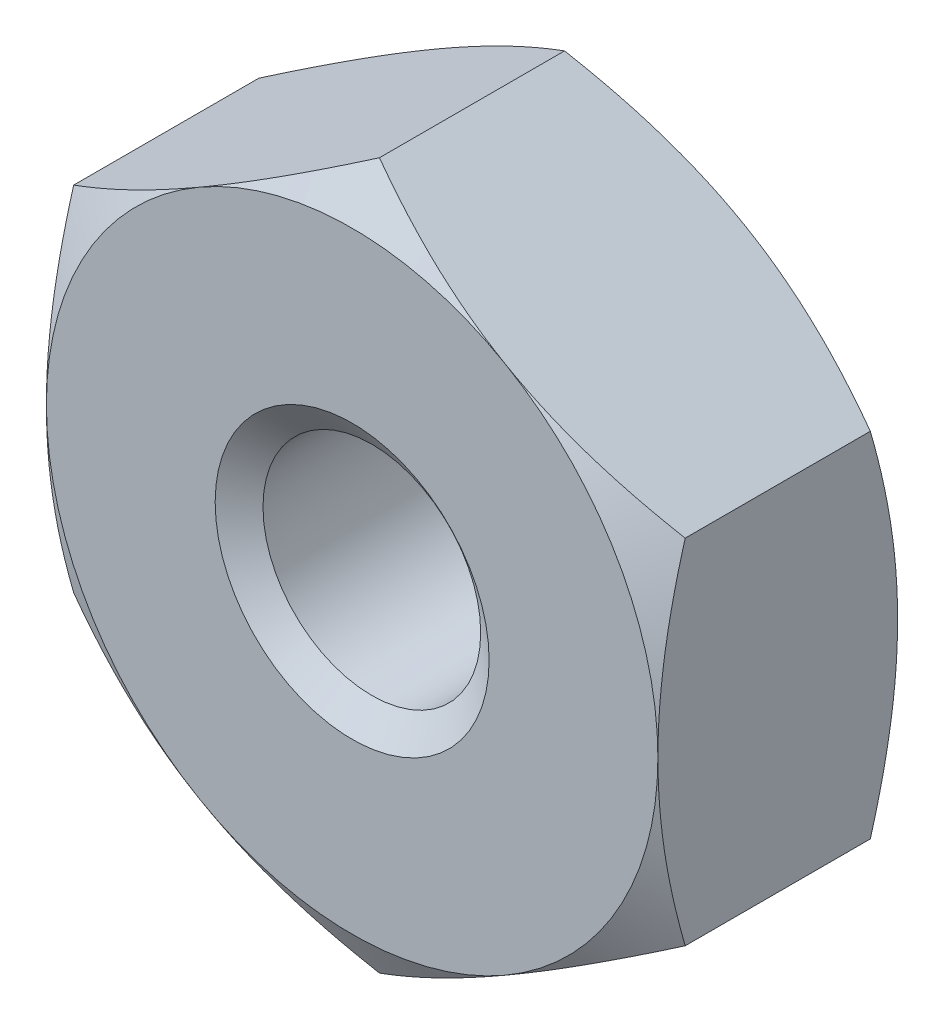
from build123d import *

# Parameters (mm, degrees)
BASENUT_START = -2.4892
BASENUTSKE_R  = 1.1303
BASENUT_DEPTH = 2.4892


with BuildPart() as part:
    # BaseNutSke → BaseNut (new body)
    with BuildSketch(Plane.XY.offset(BASENUT_START)):
        Polygon((3.175, 1.833087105), (3.175, -1.833087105), (0, -3.666174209), (-3.175, -1.833087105), (-3.175, 1.833087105), (0, 3.666174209), align=None)
        Circle(BASENUTSKE_R, mode=Mode.SUBTRACT)
    extrude(amount=BASENUT_DEPTH)

    # Sketch3 → Double-Chamfer (revolve, cut)
    with BuildSketch(Plane(origin=(0, 0, 0), x_dir=(0, 0, -1), z_dir=(1, 0, 0))):
        Polygon((2.4892, 3.175), (2.205620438, 3.666174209), (2.205620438, 16.366174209), (15.1892, 16.366174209), (15.1892, 3.175), align=None)
        Polygon((0.283579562, 16.366174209), (-12.7, 16.366174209), (-12.7, 3.175), (0, 3.175), (0.283579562, 3.666174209), align=None)
    revolve(axis=Axis((0, 0, 0), (0, 0, -1)), mode=Mode.SUBTRACT)

    # EndChamferSketch → EndChamfer (revolve, cut)
    with BuildSketch(Plane(origin=(0, 0, 0), x_dir=(0, 0, -1), z_dir=(1, 0, 0)), mode=Mode.PRIVATE) as endchamfer_sk:
        Polygon((2.4638, 1.4224), (2.238816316, 1.10109), (2.5146, 1.10109), (2.5146, 1.4224), align=None)
        Polygon((-0.0508, 1.4224), (0, 1.4224), (0.224983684, 1.10109), (-0.0508, 1.10109), align=None)
    revolve(endchamfer_sk.sketch.rotate(Axis((0, 0, -25.037505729), (0, 0, -1)), 90), axis=Axis((0, 0, -25.037505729), (0, 0, -1)), mode=Mode.SUBTRACT)


solid = part.part
